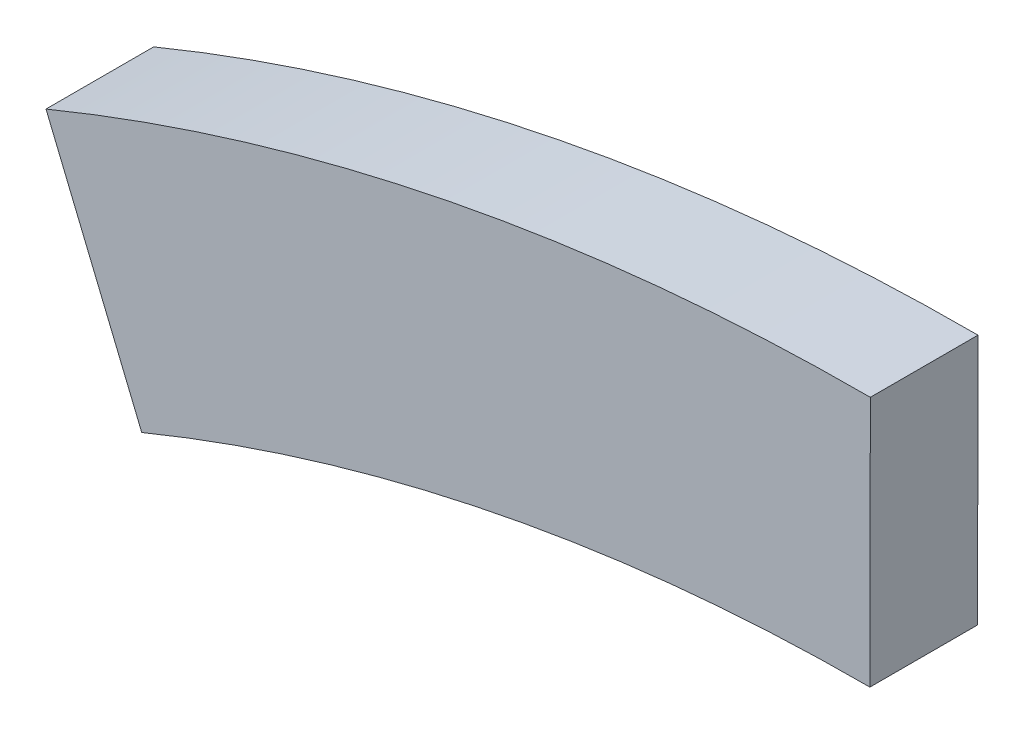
from build123d import *

# Parameters (mm, degrees)
BOSS_EXTRUDE1_DEPTH = 38.1


with BuildPart() as part:
    # Sketch2 → Boss-Extrude1 (new body)
    with BuildSketch(Plane.XY):
        with BuildLine():
            Line((0, 0), (-33.880980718, 82.190566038))
            ThreePointArc((-33.880980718, 82.190566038), (109.138426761, 125.309846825), (257.821910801, 139.698900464))
            Line((257.821910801, 139.698900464), (257.670887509, 50.799028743))
            ThreePointArc((257.670887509, 50.799028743), (126.333809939, 38.088698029), (0, 0))
        make_face()
    extrude(amount=BOSS_EXTRUDE1_DEPTH)


solid = part.part
